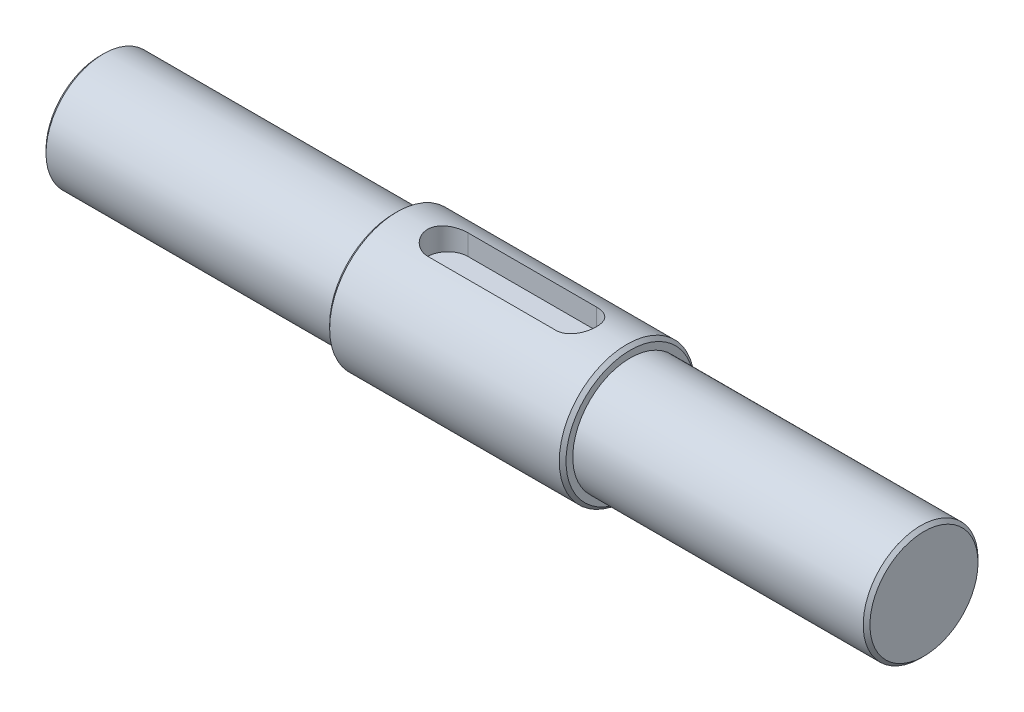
from build123d import *

# Parameters (mm, degrees)
SKETCH1_W               = 35
SKETCH1_H               = 10
SKETCH2_R               = 8.5
BOSS_EXTRUDE1_DEPTH     = 43.5
BOSS_EXTRUDE2_START     = 43.5
SKETCH3_R               = 8.5
BOSS_EXTRUDE2_DEPTH     = 43.5
CUT_EXTRUDE1_REACH      = 125.516
CUT_EXTRUDE1_END_RADIUS = 10
CHAMFER1_SIZE           = 0.5


with BuildPart() as part:
    # Sketch1 → Revolve1 (revolve)
    with BuildSketch(Plane(origin=(0, 0, 0), x_dir=(-1, 0, 0), z_dir=(0, 0, -1)), mode=Mode.PRIVATE) as revolve1_sk:
        with Locations((-61, 5)):
            Rectangle(SKETCH1_W, SKETCH1_H)
    revolve(revolve1_sk.sketch.rotate(Axis((78.5, 0, 0), (-1, 0, 0)), 270), axis=Axis((78.5, 0, 0), (-1, 0, 0)))

    # Sketch2 → Boss-Extrude1 (add)
    with BuildSketch(Plane(origin=(78.5, 0, 0), x_dir=(0, 0, -1), z_dir=(1, 0, 0))):
        Circle(SKETCH2_R)
    extrude(amount=BOSS_EXTRUDE1_DEPTH)

    # Sketch3 → Boss-Extrude2 (add)
    with BuildSketch(Plane.ZY.offset(-43.5).offset(BOSS_EXTRUDE2_START)):
        with Locations(Location((0, 0, 0), (0, 0, 180))):
            Circle(SKETCH3_R)
    extrude(amount=-BOSS_EXTRUDE2_DEPTH)

    # Cut-Extrude1: up to this cylinder (the profile starts inside it)
    cut_extrude1_end = Plane(origin=(61, 0, 0), z_dir=(-1, 0, 0)) * Cylinder(CUT_EXTRUDE1_END_RADIUS, 272.032, mode=Mode.PRIVATE)
    # Sketch4 → Cut-Extrude1 (cut, up to the surface)
    with BuildSketch(Plane.XZ.offset(-6.5), mode=Mode.PRIVATE) as cut_extrude1_sk1:
        with BuildLine():
            Line((70.5, 3), (51.5, 3))
            ThreePointArc((51.5, 3), (48.5, 0), (51.5, -3))
            Line((51.5, -3), (70.5, -3))
            ThreePointArc((70.5, -3), (73.5, 0), (70.5, 3))
        make_face()
    cut_extrude1_tool1 = extrude(cut_extrude1_sk1.sketch, amount=-CUT_EXTRUDE1_REACH, mode=Mode.PRIVATE) & cut_extrude1_end
    add(cut_extrude1_tool1.solids().sort_by_distance((61, 6.5, 0))[0], mode=Mode.SUBTRACT)

    # Chamfer1
    chamfer1_edges = [part.edges().sort_by_distance(p)[0] for p in [
        (122, 0, 8.5),
        (0, 0, 8.5),
        (43.5, 0, -10),
        (78.5, 0, -10),
    ]]
    chamfer(chamfer1_edges, length=CHAMFER1_SIZE)


solid = part.part
